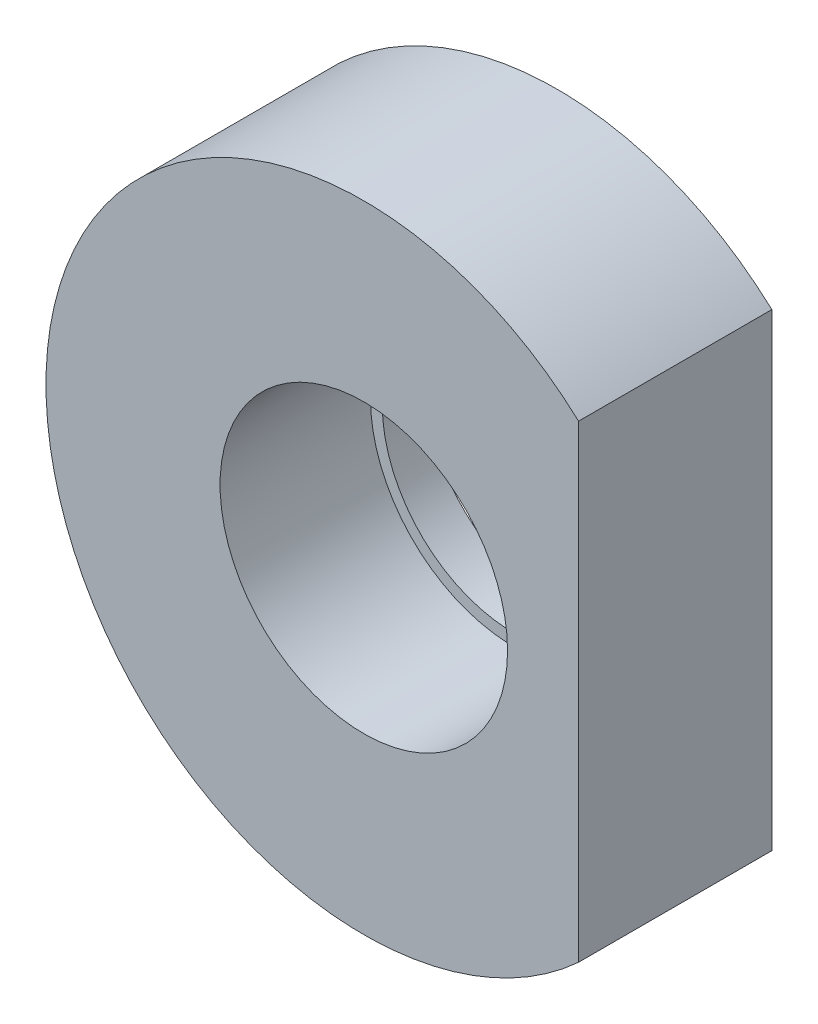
ISO-10303-21;
HEADER;
FILE_DESCRIPTION(('STEP AP214'),'2;1');
FILE_NAME('part.step','',(''),(''),'','','');
FILE_SCHEMA(('AUTOMOTIVE_DESIGN { 1 0 10303 214 1 1 1 1 }'));
ENDSEC;
DATA;
#1=APPLICATION_CONTEXT('core data for automotive mechanical design processes');
#2=APPLICATION_PROTOCOL_DEFINITION('international standard','automotive_design',2000,#1);
#3=PRODUCT_CONTEXT('',#1,'mechanical');
#4=PRODUCT('Part','Part','',(#3));
#5=PRODUCT_RELATED_PRODUCT_CATEGORY('part','',(#4));
#6=PRODUCT_DEFINITION_FORMATION('','',#4);
#7=PRODUCT_DEFINITION_CONTEXT('part definition',#1,'design');
#8=PRODUCT_DEFINITION('design','',#6,#7);
#9=PRODUCT_DEFINITION_SHAPE('','',#8);
#10=(LENGTH_UNIT() NAMED_UNIT(*) SI_UNIT(.MILLI.,.METRE.));
#11=(NAMED_UNIT(*) PLANE_ANGLE_UNIT() SI_UNIT($,.RADIAN.));
#12=(NAMED_UNIT(*) SI_UNIT($,.STERADIAN.) SOLID_ANGLE_UNIT());
#13=UNCERTAINTY_MEASURE_WITH_UNIT(LENGTH_MEASURE(1.E-05),#10,'distance_accuracy_value','');
#14=(GEOMETRIC_REPRESENTATION_CONTEXT(3) GLOBAL_UNCERTAINTY_ASSIGNED_CONTEXT((#13)) GLOBAL_UNIT_ASSIGNED_CONTEXT((#10,
#11,#12)) REPRESENTATION_CONTEXT('',''));
#15=CARTESIAN_POINT('',(0.,0.,0.));
#16=DIRECTION('',(0.,0.,1.));
#17=DIRECTION('',(1.,0.,0.));
#18=AXIS2_PLACEMENT_3D('',#15,#16,#17);
#19=CARTESIAN_POINT('',(0.,-9.0043,2.54));
#20=DIRECTION('',(0.,0.,-1.));
#21=DIRECTION('',(0.,1.,0.));
#22=AXIS2_PLACEMENT_3D('',#19,#20,#21);
#23=PLANE('',#22);
#24=CARTESIAN_POINT('',(0.,0.,2.54));
#25=DIRECTION('',(0.,0.,1.));
#26=DIRECTION('',(1.,0.,0.));
#27=AXIS2_PLACEMENT_3D('',#24,#25,#26);
#28=CIRCLE('',#27,7.8);
#29=CARTESIAN_POINT('',(7.8,0.,2.54));
#30=VERTEX_POINT('',#29);
#31=EDGE_CURVE('E61',#30,#30,#28,.T.);
#32=ORIENTED_EDGE('',*,*,#31,.F.);
#33=EDGE_LOOP('',(#32));
#34=FACE_BOUND('',#33,.T.);
#35=CARTESIAN_POINT('',(0.,0.,2.54));
#36=DIRECTION('',(0.,0.,-1.));
#37=DIRECTION('',(-1.,0.,0.));
#38=AXIS2_PLACEMENT_3D('',#35,#36,#37);
#39=CIRCLE('',#38,8.5);
#40=CARTESIAN_POINT('',(-8.5,0.,2.54));
#41=VERTEX_POINT('',#40);
#42=EDGE_CURVE('E9',#41,#41,#39,.T.);
#43=ORIENTED_EDGE('',*,*,#42,.F.);
#44=EDGE_LOOP('',(#43));
#45=FACE_BOUND('',#44,.T.);
#46=ADVANCED_FACE('F14',(#34,#45),#23,.F.);
#47=CARTESIAN_POINT('',(0.,0.,11.43));
#48=DIRECTION('',(0.,0.,-1.));
#49=DIRECTION('',(0.,1.,0.));
#50=AXIS2_PLACEMENT_3D('',#47,#48,#49);
#51=CYLINDRICAL_SURFACE('',#50,18.796);
#52=DIRECTION('',(0.,0.,-1.));
#53=VECTOR('',#52,1.);
#54=CARTESIAN_POINT('',(12.7,-13.8563926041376,82.2599418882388));
#55=LINE('',#54,#53);
#56=CARTESIAN_POINT('',(12.7,-13.8563926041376,11.43));
#57=VERTEX_POINT('',#56);
#58=CARTESIAN_POINT('',(12.7,-13.8563926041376,0.));
#59=VERTEX_POINT('',#58);
#60=EDGE_CURVE('E35',#57,#59,#55,.T.);
#61=ORIENTED_EDGE('',*,*,#60,.F.);
#62=CARTESIAN_POINT('',(0.,0.,11.43));
#63=DIRECTION('',(0.,0.,1.));
#64=DIRECTION('',(0.,-1.,0.));
#65=AXIS2_PLACEMENT_3D('',#62,#63,#64);
#66=CIRCLE('',#65,18.796);
#67=CARTESIAN_POINT('',(12.7,13.8563926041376,11.43));
#68=VERTEX_POINT('',#67);
#69=EDGE_CURVE('E47',#68,#57,#66,.T.);
#70=ORIENTED_EDGE('',*,*,#69,.F.);
#71=DIRECTION('',(0.,0.,-1.));
#72=VECTOR('',#71,1.);
#73=CARTESIAN_POINT('',(12.7,13.8563926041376,82.2599418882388));
#74=LINE('',#73,#72);
#75=CARTESIAN_POINT('',(12.7,13.8563926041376,0.));
#76=VERTEX_POINT('',#75);
#77=EDGE_CURVE('E50',#68,#76,#74,.T.);
#78=ORIENTED_EDGE('',*,*,#77,.T.);
#79=CARTESIAN_POINT('',(0.,0.,0.));
#80=DIRECTION('',(0.,0.,1.));
#81=DIRECTION('',(0.,-1.,0.));
#82=AXIS2_PLACEMENT_3D('',#79,#80,#81);
#83=CIRCLE('',#82,18.796);
#84=EDGE_CURVE('E42',#76,#59,#83,.T.);
#85=ORIENTED_EDGE('',*,*,#84,.T.);
#86=EDGE_LOOP('',(#61,#70,#78,#85));
#87=FACE_BOUND('',#86,.T.);
#88=ADVANCED_FACE('F16',(#87),#51,.T.);
#89=CARTESIAN_POINT('',(0.,0.,11.43));
#90=DIRECTION('',(0.,0.,1.));
#91=DIRECTION('',(0.,-1.,0.));
#92=AXIS2_PLACEMENT_3D('',#89,#90,#91);
#93=PLANE('',#92);
#94=ORIENTED_EDGE('',*,*,#69,.T.);
#95=DIRECTION('',(0.,1.,0.));
#96=VECTOR('',#95,1.);
#97=CARTESIAN_POINT('',(12.7,0.,11.43));
#98=LINE('',#97,#96);
#99=EDGE_CURVE('E28',#57,#68,#98,.T.);
#100=ORIENTED_EDGE('',*,*,#99,.T.);
#101=EDGE_LOOP('',(#94,#100));
#102=FACE_BOUND('',#101,.T.);
#103=CARTESIAN_POINT('',(0.,0.,11.43));
#104=DIRECTION('',(0.,0.,1.));
#105=DIRECTION('',(1.,0.,0.));
#106=AXIS2_PLACEMENT_3D('',#103,#104,#105);
#107=CIRCLE('',#106,8.5);
#108=CARTESIAN_POINT('',(8.5,0.,11.43));
#109=VERTEX_POINT('',#108);
#110=EDGE_CURVE('E64',#109,#109,#107,.T.);
#111=ORIENTED_EDGE('',*,*,#110,.F.);
#112=EDGE_LOOP('',(#111));
#113=FACE_BOUND('',#112,.T.);
#114=ADVANCED_FACE('F71',(#102,#113),#93,.T.);
#115=CARTESIAN_POINT('',(0.,0.,0.));
#116=DIRECTION('',(0.,0.,1.));
#117=DIRECTION('',(0.,-1.,0.));
#118=AXIS2_PLACEMENT_3D('',#115,#116,#117);
#119=PLANE('',#118);
#120=DIRECTION('',(0.,1.,0.));
#121=VECTOR('',#120,1.);
#122=CARTESIAN_POINT('',(12.7,0.,0.));
#123=LINE('',#122,#121);
#124=EDGE_CURVE('E22',#59,#76,#123,.T.);
#125=ORIENTED_EDGE('',*,*,#124,.F.);
#126=ORIENTED_EDGE('',*,*,#84,.F.);
#127=EDGE_LOOP('',(#125,#126));
#128=FACE_BOUND('',#127,.T.);
#129=CARTESIAN_POINT('',(0.,0.,0.));
#130=DIRECTION('',(0.,0.,1.));
#131=DIRECTION('',(1.,0.,0.));
#132=AXIS2_PLACEMENT_3D('',#129,#130,#131);
#133=CIRCLE('',#132,7.8);
#134=CARTESIAN_POINT('',(7.8,0.,0.));
#135=VERTEX_POINT('',#134);
#136=EDGE_CURVE('E52',#135,#135,#133,.F.);
#137=ORIENTED_EDGE('',*,*,#136,.F.);
#138=EDGE_LOOP('',(#137));
#139=FACE_BOUND('',#138,.T.);
#140=ADVANCED_FACE('F44',(#128,#139),#119,.F.);
#141=CARTESIAN_POINT('',(12.7,13.8563926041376,82.2599418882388));
#142=DIRECTION('',(1.,0.,0.));
#143=DIRECTION('',(0.,0.,1.));
#144=AXIS2_PLACEMENT_3D('',#141,#142,#143);
#145=PLANE('',#144);
#146=ORIENTED_EDGE('',*,*,#99,.F.);
#147=ORIENTED_EDGE('',*,*,#60,.T.);
#148=ORIENTED_EDGE('',*,*,#124,.T.);
#149=ORIENTED_EDGE('',*,*,#77,.F.);
#150=EDGE_LOOP('',(#146,#147,#148,#149));
#151=FACE_BOUND('',#150,.T.);
#152=ADVANCED_FACE('F54',(#151),#145,.T.);
#153=CARTESIAN_POINT('',(0.,0.,-26.1009588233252));
#154=DIRECTION('',(0.,0.,1.));
#155=DIRECTION('',(1.,0.,0.));
#156=AXIS2_PLACEMENT_3D('',#153,#154,#155);
#157=CYLINDRICAL_SURFACE('',#156,7.8);
#158=ORIENTED_EDGE('',*,*,#136,.T.);
#159=EDGE_LOOP('',(#158));
#160=FACE_BOUND('',#159,.T.);
#161=ORIENTED_EDGE('',*,*,#31,.T.);
#162=EDGE_LOOP('',(#161));
#163=FACE_BOUND('',#162,.T.);
#164=ADVANCED_FACE('F90',(#160,#163),#157,.F.);
#165=CARTESIAN_POINT('',(0.,0.,-25.0206691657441));
#166=DIRECTION('',(0.,0.,1.));
#167=DIRECTION('',(1.,0.,0.));
#168=AXIS2_PLACEMENT_3D('',#165,#166,#167);
#169=CYLINDRICAL_SURFACE('',#168,8.5);
#170=ORIENTED_EDGE('',*,*,#110,.T.);
#171=EDGE_LOOP('',(#170));
#172=FACE_BOUND('',#171,.T.);
#173=ORIENTED_EDGE('',*,*,#42,.T.);
#174=EDGE_LOOP('',(#173));
#175=FACE_BOUND('',#174,.T.);
#176=ADVANCED_FACE('F68',(#172,#175),#169,.F.);
#177=CLOSED_SHELL('',(#46,#88,#114,#140,#152,#164,#176));
#178=MANIFOLD_SOLID_BREP('B1',#177);
#179=ADVANCED_BREP_SHAPE_REPRESENTATION('',(#18,#178),#14);
#180=SHAPE_DEFINITION_REPRESENTATION(#9,#179);
ENDSEC;
END-ISO-10303-21;
